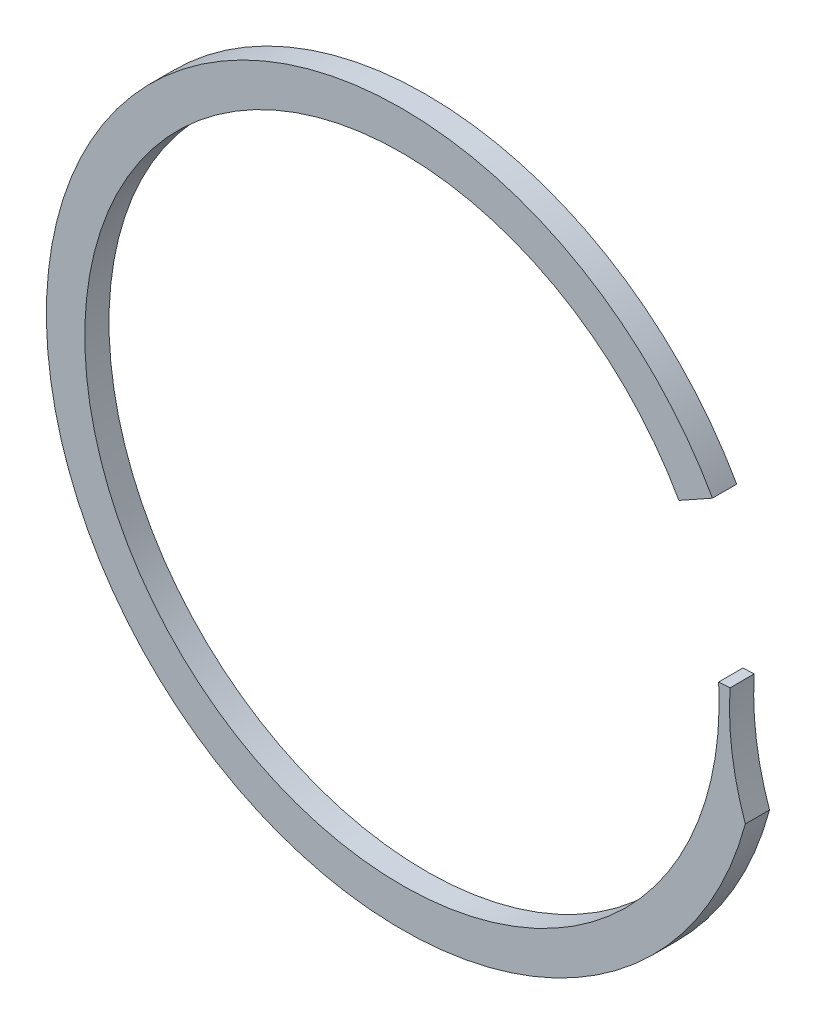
from build123d import *

# Parameters (mm, degrees)
SKETCH1_R          = 10.8204
EXTRUDE1_DEPTH     = 0.7366
SKETCH2_R          = 9.652
CUT_EXTRUDE1_DEPTH = 16.3200748
CUT_EXTRUDE2_DEPTH = 16.3200748
SKETCH4_R          = 8.440063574
CUT_EXTRUDE3_DEPTH = 16.3200748


with BuildPart() as part:
    # Sketch1 → Extrude1 (new body)
    with BuildSketch(Plane.XY):
        Circle(SKETCH1_R)
    extrude(amount=EXTRUDE1_DEPTH)

    # Sketch2 → Cut-Extrude1 (cut, through all)
    with BuildSketch(Plane.XY.offset(0.7366)):
        Circle(SKETCH2_R)
    extrude(amount=-CUT_EXTRUDE1_DEPTH, mode=Mode.SUBTRACT)

    # Sketch3 → Cut-Extrude2 (cut, through all)
    with BuildSketch(Plane.XY.offset(0.7366)):
        Polygon((0, 0), (16.00493016, 8.933499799), (16.748575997, 0.9122666), align=None)
    extrude(amount=-CUT_EXTRUDE2_DEPTH, mode=Mode.SUBTRACT)

    # Sketch4 → Cut-Extrude3 (cut, through all)
    with BuildSketch(Plane.XY.offset(0.7366)):
        with Locations((18.406216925, 0)):
            Circle(SKETCH4_R)
    extrude(amount=-CUT_EXTRUDE3_DEPTH, mode=Mode.SUBTRACT)


solid = part.part
